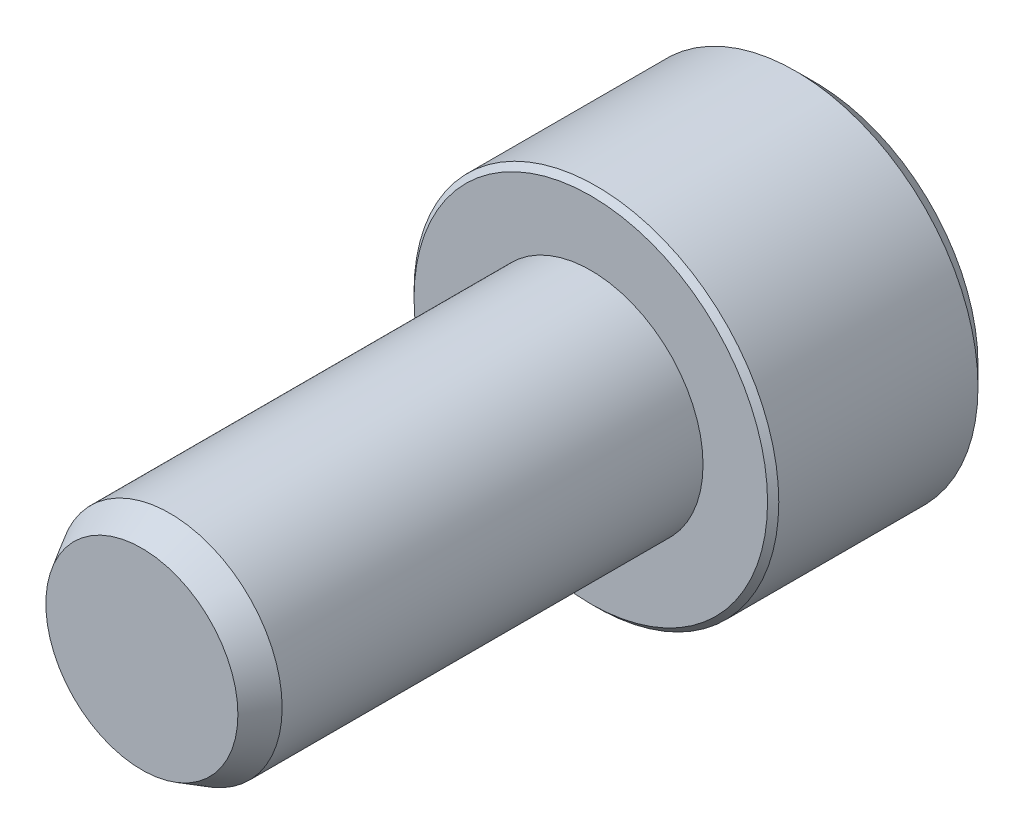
ISO-10303-21;
HEADER;
FILE_DESCRIPTION(('STEP AP214'),'2;1');
FILE_NAME('part.step','',(''),(''),'','','');
FILE_SCHEMA(('AUTOMOTIVE_DESIGN { 1 0 10303 214 1 1 1 1 }'));
ENDSEC;
DATA;
#1=APPLICATION_CONTEXT('core data for automotive mechanical design processes');
#2=APPLICATION_PROTOCOL_DEFINITION('international standard','automotive_design',2000,#1);
#3=PRODUCT_CONTEXT('',#1,'mechanical');
#4=PRODUCT('Part','Part','',(#3));
#5=PRODUCT_RELATED_PRODUCT_CATEGORY('part','',(#4));
#6=PRODUCT_DEFINITION_FORMATION('','',#4);
#7=PRODUCT_DEFINITION_CONTEXT('part definition',#1,'design');
#8=PRODUCT_DEFINITION('design','',#6,#7);
#9=PRODUCT_DEFINITION_SHAPE('','',#8);
#10=(LENGTH_UNIT() NAMED_UNIT(*) SI_UNIT(.MILLI.,.METRE.));
#11=(NAMED_UNIT(*) PLANE_ANGLE_UNIT() SI_UNIT($,.RADIAN.));
#12=(NAMED_UNIT(*) SI_UNIT($,.STERADIAN.) SOLID_ANGLE_UNIT());
#13=UNCERTAINTY_MEASURE_WITH_UNIT(LENGTH_MEASURE(1.E-05),#10,'distance_accuracy_value','');
#14=(GEOMETRIC_REPRESENTATION_CONTEXT(3) GLOBAL_UNCERTAINTY_ASSIGNED_CONTEXT((#13)) GLOBAL_UNIT_ASSIGNED_CONTEXT((#10,
#11,#12)) REPRESENTATION_CONTEXT('',''));
#15=CARTESIAN_POINT('',(0.,0.,0.));
#16=DIRECTION('',(0.,0.,1.));
#17=DIRECTION('',(1.,0.,0.));
#18=AXIS2_PLACEMENT_3D('',#15,#16,#17);
#19=CARTESIAN_POINT('',(0.,0.,16.));
#20=DIRECTION('',(0.,0.,-1.));
#21=DIRECTION('',(-1.,0.,0.));
#22=AXIS2_PLACEMENT_3D('',#19,#20,#21);
#23=CYLINDRICAL_SURFACE('',#22,4.);
#24=CARTESIAN_POINT('',(0.,0.,15.));
#25=DIRECTION('',(0.,0.,1.));
#26=DIRECTION('',(1.,0.,0.));
#27=AXIS2_PLACEMENT_3D('',#24,#25,#26);
#28=CIRCLE('',#27,4.);
#29=CARTESIAN_POINT('',(4.,0.,15.));
#30=VERTEX_POINT('',#29);
#31=EDGE_CURVE('E150',#30,#30,#28,.F.);
#32=ORIENTED_EDGE('',*,*,#31,.T.);
#33=EDGE_LOOP('',(#32));
#34=FACE_BOUND('',#33,.T.);
#35=CARTESIAN_POINT('',(0.,0.,0.));
#36=DIRECTION('',(0.,0.,1.));
#37=DIRECTION('',(1.,0.,0.));
#38=AXIS2_PLACEMENT_3D('',#35,#36,#37);
#39=CIRCLE('',#38,4.);
#40=CARTESIAN_POINT('',(4.,0.,0.));
#41=VERTEX_POINT('',#40);
#42=EDGE_CURVE('E132',#41,#41,#39,.T.);
#43=ORIENTED_EDGE('',*,*,#42,.T.);
#44=EDGE_LOOP('',(#43));
#45=FACE_BOUND('',#44,.T.);
#46=ADVANCED_FACE('F31',(#34,#45),#23,.T.);
#47=CARTESIAN_POINT('',(0.,0.,16.));
#48=DIRECTION('',(0.,0.,1.));
#49=DIRECTION('',(1.,0.,0.));
#50=AXIS2_PLACEMENT_3D('',#47,#48,#49);
#51=PLANE('',#50);
#52=CARTESIAN_POINT('',(0.,0.,16.));
#53=DIRECTION('',(0.,0.,1.));
#54=DIRECTION('',(1.,0.,0.));
#55=AXIS2_PLACEMENT_3D('',#52,#53,#54);
#56=CIRCLE('',#55,3.42264973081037);
#57=CARTESIAN_POINT('',(3.42264973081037,0.,16.));
#58=VERTEX_POINT('',#57);
#59=EDGE_CURVE('E147',#58,#58,#56,.T.);
#60=ORIENTED_EDGE('',*,*,#59,.T.);
#61=EDGE_LOOP('',(#60));
#62=FACE_BOUND('',#61,.T.);
#63=ADVANCED_FACE('F171',(#62),#51,.T.);
#64=CARTESIAN_POINT('',(0.,0.,0.));
#65=DIRECTION('',(0.,0.,1.));
#66=DIRECTION('',(1.,0.,0.));
#67=AXIS2_PLACEMENT_3D('',#64,#65,#66);
#68=PLANE('',#67);
#69=CARTESIAN_POINT('',(0.,0.,0.));
#70=DIRECTION('',(0.,0.,1.));
#71=DIRECTION('',(1.,0.,0.));
#72=AXIS2_PLACEMENT_3D('',#69,#70,#71);
#73=CIRCLE('',#72,6.3);
#74=CARTESIAN_POINT('',(-6.3,0.,0.));
#75=VERTEX_POINT('',#74);
#76=EDGE_CURVE('E38',#75,#75,#73,.T.);
#77=ORIENTED_EDGE('',*,*,#76,.T.);
#78=EDGE_LOOP('',(#77));
#79=FACE_BOUND('',#78,.T.);
#80=ORIENTED_EDGE('',*,*,#42,.F.);
#81=EDGE_LOOP('',(#80));
#82=FACE_BOUND('',#81,.T.);
#83=ADVANCED_FACE('F155',(#79,#82),#68,.T.);
#84=CARTESIAN_POINT('',(0.,0.,-8.));
#85=DIRECTION('',(0.,0.,1.));
#86=DIRECTION('',(1.,0.,0.));
#87=AXIS2_PLACEMENT_3D('',#84,#85,#86);
#88=CYLINDRICAL_SURFACE('',#87,6.5);
#89=CARTESIAN_POINT('',(0.,0.,-0.2));
#90=DIRECTION('',(0.,0.,1.));
#91=DIRECTION('',(1.,0.,0.));
#92=AXIS2_PLACEMENT_3D('',#89,#90,#91);
#93=CIRCLE('',#92,6.5);
#94=CARTESIAN_POINT('',(-6.5,0.,-0.2));
#95=VERTEX_POINT('',#94);
#96=EDGE_CURVE('E11',#95,#95,#93,.F.);
#97=ORIENTED_EDGE('',*,*,#96,.T.);
#98=EDGE_LOOP('',(#97));
#99=FACE_BOUND('',#98,.T.);
#100=CARTESIAN_POINT('',(0.,0.,-7.3));
#101=DIRECTION('',(0.,0.,1.));
#102=DIRECTION('',(1.,0.,0.));
#103=AXIS2_PLACEMENT_3D('',#100,#101,#102);
#104=CIRCLE('',#103,6.5);
#105=CARTESIAN_POINT('',(6.5,0.,-7.3));
#106=VERTEX_POINT('',#105);
#107=EDGE_CURVE('E141',#106,#106,#104,.T.);
#108=ORIENTED_EDGE('',*,*,#107,.T.);
#109=EDGE_LOOP('',(#108));
#110=FACE_BOUND('',#109,.T.);
#111=ADVANCED_FACE('F181',(#99,#110),#88,.T.);
#112=CARTESIAN_POINT('',(0.,0.,-8.));
#113=DIRECTION('',(0.,0.,1.));
#114=DIRECTION('',(1.,0.,0.));
#115=AXIS2_PLACEMENT_3D('',#112,#113,#114);
#116=PLANE('',#115);
#117=CARTESIAN_POINT('',(0.,0.,-8.));
#118=DIRECTION('',(0.,0.,1.));
#119=DIRECTION('',(1.,0.,0.));
#120=AXIS2_PLACEMENT_3D('',#117,#118,#119);
#121=CIRCLE('',#120,5.8);
#122=CARTESIAN_POINT('',(5.8,0.,-8.));
#123=VERTEX_POINT('',#122);
#124=EDGE_CURVE('E144',#123,#123,#121,.F.);
#125=ORIENTED_EDGE('',*,*,#124,.T.);
#126=EDGE_LOOP('',(#125));
#127=FACE_BOUND('',#126,.T.);
#128=DIRECTION('',(0.5,0.866025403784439,0.));
#129=VECTOR('',#128,1.);
#130=CARTESIAN_POINT('',(-3.46410161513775,0.,-8.));
#131=LINE('',#130,#129);
#132=CARTESIAN_POINT('',(-3.46410161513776,0.,-8.));
#133=VERTEX_POINT('',#132);
#134=CARTESIAN_POINT('',(-1.73205080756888,3.,-8.));
#135=VERTEX_POINT('',#134);
#136=EDGE_CURVE('E99',#133,#135,#131,.T.);
#137=ORIENTED_EDGE('',*,*,#136,.F.);
#138=DIRECTION('',(-0.5,0.866025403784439,0.));
#139=VECTOR('',#138,1.);
#140=CARTESIAN_POINT('',(-1.73205080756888,-3.,-8.));
#141=LINE('',#140,#139);
#142=CARTESIAN_POINT('',(-1.73205080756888,-3.,-8.));
#143=VERTEX_POINT('',#142);
#144=EDGE_CURVE('E45',#143,#133,#141,.T.);
#145=ORIENTED_EDGE('',*,*,#144,.F.);
#146=DIRECTION('',(-1.,0.,0.));
#147=VECTOR('',#146,1.);
#148=CARTESIAN_POINT('',(1.73205080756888,-3.,-8.));
#149=LINE('',#148,#147);
#150=CARTESIAN_POINT('',(1.73205080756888,-3.,-8.));
#151=VERTEX_POINT('',#150);
#152=EDGE_CURVE('E114',#151,#143,#149,.T.);
#153=ORIENTED_EDGE('',*,*,#152,.F.);
#154=DIRECTION('',(-0.5,-0.866025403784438,0.));
#155=VECTOR('',#154,1.);
#156=CARTESIAN_POINT('',(3.46410161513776,0.,-8.));
#157=LINE('',#156,#155);
#158=CARTESIAN_POINT('',(3.46410161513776,0.,-8.));
#159=VERTEX_POINT('',#158);
#160=EDGE_CURVE('E108',#159,#151,#157,.T.);
#161=ORIENTED_EDGE('',*,*,#160,.F.);
#162=DIRECTION('',(0.5,-0.866025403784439,0.));
#163=VECTOR('',#162,1.);
#164=CARTESIAN_POINT('',(1.73205080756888,3.,-8.));
#165=LINE('',#164,#163);
#166=CARTESIAN_POINT('',(1.73205080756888,3.,-8.));
#167=VERTEX_POINT('',#166);
#168=EDGE_CURVE('E106',#167,#159,#165,.T.);
#169=ORIENTED_EDGE('',*,*,#168,.F.);
#170=DIRECTION('',(1.,0.,0.));
#171=VECTOR('',#170,1.);
#172=CARTESIAN_POINT('',(-1.73205080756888,3.,-8.));
#173=LINE('',#172,#171);
#174=EDGE_CURVE('E88',#135,#167,#173,.T.);
#175=ORIENTED_EDGE('',*,*,#174,.F.);
#176=EDGE_LOOP('',(#137,#145,#153,#161,#169,#175));
#177=FACE_BOUND('',#176,.T.);
#178=ADVANCED_FACE('F103',(#127,#177),#116,.F.);
#179=CARTESIAN_POINT('',(-1.73205080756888,-3.,-3.5));
#180=DIRECTION('',(-0.866025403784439,-0.5,0.));
#181=DIRECTION('',(0.5,-0.866025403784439,0.));
#182=AXIS2_PLACEMENT_3D('',#179,#180,#181);
#183=PLANE('',#182);
#184=ORIENTED_EDGE('',*,*,#144,.T.);
#185=DIRECTION('',(0.,0.,-1.));
#186=VECTOR('',#185,1.);
#187=CARTESIAN_POINT('',(-3.46410161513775,0.,-3.5));
#188=LINE('',#187,#186);
#189=CARTESIAN_POINT('',(-3.46410161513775,0.,-3.5));
#190=VERTEX_POINT('',#189);
#191=EDGE_CURVE('E96',#190,#133,#188,.T.);
#192=ORIENTED_EDGE('',*,*,#191,.F.);
#193=DIRECTION('',(-0.5,0.866025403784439,0.));
#194=VECTOR('',#193,1.);
#195=CARTESIAN_POINT('',(-1.73205080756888,-3.,-3.5));
#196=LINE('',#195,#194);
#197=CARTESIAN_POINT('',(-1.73205080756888,-3.,-3.5));
#198=VERTEX_POINT('',#197);
#199=EDGE_CURVE('E116',#198,#190,#196,.T.);
#200=ORIENTED_EDGE('',*,*,#199,.F.);
#201=DIRECTION('',(0.,0.,-1.));
#202=VECTOR('',#201,1.);
#203=CARTESIAN_POINT('',(-1.73205080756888,-3.,-3.5));
#204=LINE('',#203,#202);
#205=EDGE_CURVE('E52',#198,#143,#204,.T.);
#206=ORIENTED_EDGE('',*,*,#205,.T.);
#207=EDGE_LOOP('',(#184,#192,#200,#206));
#208=FACE_BOUND('',#207,.T.);
#209=ADVANCED_FACE('F190',(#208),#183,.F.);
#210=CARTESIAN_POINT('',(1.73205080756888,-3.,-3.5));
#211=DIRECTION('',(0.,-1.,0.));
#212=DIRECTION('',(0.,0.,-1.));
#213=AXIS2_PLACEMENT_3D('',#210,#211,#212);
#214=PLANE('',#213);
#215=ORIENTED_EDGE('',*,*,#152,.T.);
#216=ORIENTED_EDGE('',*,*,#205,.F.);
#217=DIRECTION('',(-1.,0.,0.));
#218=VECTOR('',#217,1.);
#219=CARTESIAN_POINT('',(1.73205080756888,-3.,-3.5));
#220=LINE('',#219,#218);
#221=CARTESIAN_POINT('',(1.73205080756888,-3.,-3.5));
#222=VERTEX_POINT('',#221);
#223=EDGE_CURVE('E128',#222,#198,#220,.T.);
#224=ORIENTED_EDGE('',*,*,#223,.F.);
#225=DIRECTION('',(0.,0.,-1.));
#226=VECTOR('',#225,1.);
#227=CARTESIAN_POINT('',(1.73205080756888,-3.,-3.5));
#228=LINE('',#227,#226);
#229=EDGE_CURVE('E133',#222,#151,#228,.T.);
#230=ORIENTED_EDGE('',*,*,#229,.T.);
#231=EDGE_LOOP('',(#215,#216,#224,#230));
#232=FACE_BOUND('',#231,.T.);
#233=ADVANCED_FACE('F197',(#232),#214,.F.);
#234=CARTESIAN_POINT('',(3.46410161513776,0.,-3.5));
#235=DIRECTION('',(0.866025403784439,-0.5,0.));
#236=DIRECTION('',(0.5,0.866025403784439,0.));
#237=AXIS2_PLACEMENT_3D('',#234,#235,#236);
#238=PLANE('',#237);
#239=ORIENTED_EDGE('',*,*,#160,.T.);
#240=ORIENTED_EDGE('',*,*,#229,.F.);
#241=DIRECTION('',(-0.5,-0.866025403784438,0.));
#242=VECTOR('',#241,1.);
#243=CARTESIAN_POINT('',(3.46410161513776,0.,-3.5));
#244=LINE('',#243,#242);
#245=CARTESIAN_POINT('',(3.46410161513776,0.,-3.5));
#246=VERTEX_POINT('',#245);
#247=EDGE_CURVE('E125',#246,#222,#244,.T.);
#248=ORIENTED_EDGE('',*,*,#247,.F.);
#249=DIRECTION('',(0.,0.,-1.));
#250=VECTOR('',#249,1.);
#251=CARTESIAN_POINT('',(3.46410161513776,0.,-3.5));
#252=LINE('',#251,#250);
#253=EDGE_CURVE('E135',#246,#159,#252,.T.);
#254=ORIENTED_EDGE('',*,*,#253,.T.);
#255=EDGE_LOOP('',(#239,#240,#248,#254));
#256=FACE_BOUND('',#255,.T.);
#257=ADVANCED_FACE('F214',(#256),#238,.F.);
#258=CARTESIAN_POINT('',(1.73205080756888,3.,-3.5));
#259=DIRECTION('',(0.866025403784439,0.5,0.));
#260=DIRECTION('',(-0.5,0.866025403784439,0.));
#261=AXIS2_PLACEMENT_3D('',#258,#259,#260);
#262=PLANE('',#261);
#263=ORIENTED_EDGE('',*,*,#168,.T.);
#264=ORIENTED_EDGE('',*,*,#253,.F.);
#265=DIRECTION('',(0.5,-0.866025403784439,0.));
#266=VECTOR('',#265,1.);
#267=CARTESIAN_POINT('',(1.73205080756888,3.,-3.5));
#268=LINE('',#267,#266);
#269=CARTESIAN_POINT('',(1.73205080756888,3.,-3.5));
#270=VERTEX_POINT('',#269);
#271=EDGE_CURVE('E122',#270,#246,#268,.T.);
#272=ORIENTED_EDGE('',*,*,#271,.F.);
#273=DIRECTION('',(0.,0.,-1.));
#274=VECTOR('',#273,1.);
#275=CARTESIAN_POINT('',(1.73205080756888,3.,-3.5));
#276=LINE('',#275,#274);
#277=EDGE_CURVE('E95',#270,#167,#276,.T.);
#278=ORIENTED_EDGE('',*,*,#277,.T.);
#279=EDGE_LOOP('',(#263,#264,#272,#278));
#280=FACE_BOUND('',#279,.T.);
#281=ADVANCED_FACE('F217',(#280),#262,.F.);
#282=CARTESIAN_POINT('',(-1.73205080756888,3.,-3.5));
#283=DIRECTION('',(0.,1.,0.));
#284=DIRECTION('',(0.,0.,1.));
#285=AXIS2_PLACEMENT_3D('',#282,#283,#284);
#286=PLANE('',#285);
#287=ORIENTED_EDGE('',*,*,#174,.T.);
#288=ORIENTED_EDGE('',*,*,#277,.F.);
#289=DIRECTION('',(1.,0.,0.));
#290=VECTOR('',#289,1.);
#291=CARTESIAN_POINT('',(-1.73205080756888,3.,-3.5));
#292=LINE('',#291,#290);
#293=CARTESIAN_POINT('',(-1.73205080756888,3.,-3.5));
#294=VERTEX_POINT('',#293);
#295=EDGE_CURVE('E91',#294,#270,#292,.T.);
#296=ORIENTED_EDGE('',*,*,#295,.F.);
#297=DIRECTION('',(0.,0.,-1.));
#298=VECTOR('',#297,1.);
#299=CARTESIAN_POINT('',(-1.73205080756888,3.,-3.5));
#300=LINE('',#299,#298);
#301=EDGE_CURVE('E84',#294,#135,#300,.T.);
#302=ORIENTED_EDGE('',*,*,#301,.T.);
#303=EDGE_LOOP('',(#287,#288,#296,#302));
#304=FACE_BOUND('',#303,.T.);
#305=ADVANCED_FACE('F86',(#304),#286,.F.);
#306=CARTESIAN_POINT('',(-3.46410161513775,0.,-3.5));
#307=DIRECTION('',(-0.866025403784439,0.5,0.));
#308=DIRECTION('',(-0.5,-0.866025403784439,0.));
#309=AXIS2_PLACEMENT_3D('',#306,#307,#308);
#310=PLANE('',#309);
#311=ORIENTED_EDGE('',*,*,#136,.T.);
#312=ORIENTED_EDGE('',*,*,#301,.F.);
#313=DIRECTION('',(0.5,0.866025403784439,0.));
#314=VECTOR('',#313,1.);
#315=CARTESIAN_POINT('',(-3.46410161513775,0.,-3.5));
#316=LINE('',#315,#314);
#317=EDGE_CURVE('E119',#190,#294,#316,.T.);
#318=ORIENTED_EDGE('',*,*,#317,.F.);
#319=ORIENTED_EDGE('',*,*,#191,.T.);
#320=EDGE_LOOP('',(#311,#312,#318,#319));
#321=FACE_BOUND('',#320,.T.);
#322=ADVANCED_FACE('F100',(#321),#310,.F.);
#323=CARTESIAN_POINT('',(-5.19615242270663,3.,-3.5));
#324=DIRECTION('',(0.,0.,-1.));
#325=DIRECTION('',(-1.,0.,0.));
#326=AXIS2_PLACEMENT_3D('',#323,#324,#325);
#327=PLANE('',#326);
#328=ORIENTED_EDGE('',*,*,#199,.T.);
#329=ORIENTED_EDGE('',*,*,#317,.T.);
#330=ORIENTED_EDGE('',*,*,#295,.T.);
#331=ORIENTED_EDGE('',*,*,#271,.T.);
#332=ORIENTED_EDGE('',*,*,#247,.T.);
#333=ORIENTED_EDGE('',*,*,#223,.T.);
#334=EDGE_LOOP('',(#328,#329,#330,#331,#332,#333));
#335=FACE_BOUND('',#334,.T.);
#336=ADVANCED_FACE('F202',(#335),#327,.T.);
#337=CARTESIAN_POINT('',(0.,0.,-7.3));
#338=DIRECTION('',(0.,0.,1.));
#339=DIRECTION('',(1.,0.,0.));
#340=AXIS2_PLACEMENT_3D('',#337,#338,#339);
#341=CONICAL_SURFACE('',#340,6.5,0.785398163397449);
#342=ORIENTED_EDGE('',*,*,#124,.F.);
#343=EDGE_LOOP('',(#342));
#344=FACE_BOUND('',#343,.T.);
#345=ORIENTED_EDGE('',*,*,#107,.F.);
#346=EDGE_LOOP('',(#345));
#347=FACE_BOUND('',#346,.T.);
#348=ADVANCED_FACE('F166',(#344,#347),#341,.T.);
#349=CARTESIAN_POINT('',(0.,0.,16.));
#350=DIRECTION('',(0.,0.,-1.));
#351=DIRECTION('',(-1.,0.,0.));
#352=AXIS2_PLACEMENT_3D('',#349,#350,#351);
#353=CONICAL_SURFACE('',#352,3.42264973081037,0.523598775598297);
#354=ORIENTED_EDGE('',*,*,#31,.F.);
#355=EDGE_LOOP('',(#354));
#356=FACE_BOUND('',#355,.T.);
#357=ORIENTED_EDGE('',*,*,#59,.F.);
#358=EDGE_LOOP('',(#357));
#359=FACE_BOUND('',#358,.T.);
#360=ADVANCED_FACE('F160',(#356,#359),#353,.T.);
#361=CARTESIAN_POINT('',(0.,0.,0.));
#362=DIRECTION('',(0.,0.,-1.));
#363=DIRECTION('',(-1.,0.,0.));
#364=AXIS2_PLACEMENT_3D('',#361,#362,#363);
#365=CONICAL_SURFACE('',#364,6.3,0.785398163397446);
#366=CARTESIAN_POINT('',(-6.5,0.,-0.2));
#367=CARTESIAN_POINT('',(-6.49791666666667,0.,-0.197916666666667));
#368=CARTESIAN_POINT('',(-6.49583333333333,0.,-0.195833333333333));
#369=CARTESIAN_POINT('',(-6.49166666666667,0.,-0.191666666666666));
#370=CARTESIAN_POINT('',(-6.48958333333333,0.,-0.189583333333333));
#371=CARTESIAN_POINT('',(-6.48541666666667,0.,-0.185416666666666));
#372=CARTESIAN_POINT('',(-6.48333333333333,0.,-0.183333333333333));
#373=CARTESIAN_POINT('',(-6.47916666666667,0.,-0.179166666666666));
#374=CARTESIAN_POINT('',(-6.47708333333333,0.,-0.177083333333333));
#375=CARTESIAN_POINT('',(-6.47291666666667,0.,-0.172916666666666));
#376=CARTESIAN_POINT('',(-6.47083333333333,0.,-0.170833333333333));
#377=CARTESIAN_POINT('',(-6.46666666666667,0.,-0.166666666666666));
#378=CARTESIAN_POINT('',(-6.46458333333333,0.,-0.164583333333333));
#379=CARTESIAN_POINT('',(-6.46041666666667,0.,-0.160416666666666));
#380=CARTESIAN_POINT('',(-6.45833333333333,0.,-0.158333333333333));
#381=CARTESIAN_POINT('',(-6.45416666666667,0.,-0.154166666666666));
#382=CARTESIAN_POINT('',(-6.45208333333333,0.,-0.152083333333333));
#383=CARTESIAN_POINT('',(-6.44791666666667,0.,-0.147916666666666));
#384=CARTESIAN_POINT('',(-6.44583333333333,0.,-0.145833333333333));
#385=CARTESIAN_POINT('',(-6.44166666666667,0.,-0.141666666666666));
#386=CARTESIAN_POINT('',(-6.43958333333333,0.,-0.139583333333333));
#387=CARTESIAN_POINT('',(-6.43541666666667,0.,-0.135416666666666));
#388=CARTESIAN_POINT('',(-6.43333333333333,0.,-0.133333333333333));
#389=CARTESIAN_POINT('',(-6.42916666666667,0.,-0.129166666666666));
#390=CARTESIAN_POINT('',(-6.42708333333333,0.,-0.127083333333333));
#391=CARTESIAN_POINT('',(-6.42291666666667,0.,-0.122916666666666));
#392=CARTESIAN_POINT('',(-6.42083333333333,0.,-0.120833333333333));
#393=CARTESIAN_POINT('',(-6.41666666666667,0.,-0.116666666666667));
#394=CARTESIAN_POINT('',(-6.41458333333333,0.,-0.114583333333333));
#395=CARTESIAN_POINT('',(-6.41041666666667,0.,-0.110416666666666));
#396=CARTESIAN_POINT('',(-6.40833333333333,0.,-0.108333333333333));
#397=CARTESIAN_POINT('',(-6.40416666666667,0.,-0.104166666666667));
#398=CARTESIAN_POINT('',(-6.40208333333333,0.,-0.102083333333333));
#399=CARTESIAN_POINT('',(-6.39791666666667,0.,-0.0979166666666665));
#400=CARTESIAN_POINT('',(-6.39583333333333,0.,-0.0958333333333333));
#401=CARTESIAN_POINT('',(-6.39166666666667,0.,-0.0916666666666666));
#402=CARTESIAN_POINT('',(-6.38958333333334,0.,-0.0895833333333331));
#403=CARTESIAN_POINT('',(-6.38541666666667,0.,-0.0854166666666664));
#404=CARTESIAN_POINT('',(-6.38333333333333,0.,-0.0833333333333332));
#405=CARTESIAN_POINT('',(-6.37916666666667,0.,-0.0791666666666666));
#406=CARTESIAN_POINT('',(-6.37708333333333,0.,-0.0770833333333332));
#407=CARTESIAN_POINT('',(-6.37291666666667,0.,-0.0729166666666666));
#408=CARTESIAN_POINT('',(-6.37083333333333,0.,-0.0708333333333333));
#409=CARTESIAN_POINT('',(-6.36666666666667,0.,-0.0666666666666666));
#410=CARTESIAN_POINT('',(-6.36458333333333,0.,-0.0645833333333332));
#411=CARTESIAN_POINT('',(-6.36041666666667,0.,-0.0604166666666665));
#412=CARTESIAN_POINT('',(-6.35833333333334,0.,-0.0583333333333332));
#413=CARTESIAN_POINT('',(-6.35416666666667,0.,-0.0541666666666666));
#414=CARTESIAN_POINT('',(-6.35208333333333,0.,-0.0520833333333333));
#415=CARTESIAN_POINT('',(-6.34791666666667,0.,-0.0479166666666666));
#416=CARTESIAN_POINT('',(-6.34583333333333,0.,-0.0458333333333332));
#417=CARTESIAN_POINT('',(-6.34166666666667,0.,-0.0416666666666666));
#418=CARTESIAN_POINT('',(-6.33958333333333,0.,-0.0395833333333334));
#419=CARTESIAN_POINT('',(-6.33541666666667,0.,-0.0354166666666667));
#420=CARTESIAN_POINT('',(-6.33333333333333,0.,-0.0333333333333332));
#421=CARTESIAN_POINT('',(-6.32916666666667,0.,-0.0291666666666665));
#422=CARTESIAN_POINT('',(-6.32708333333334,0.,-0.0270833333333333));
#423=CARTESIAN_POINT('',(-6.32291666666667,0.,-0.0229166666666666));
#424=CARTESIAN_POINT('',(-6.32083333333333,0.,-0.0208333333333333));
#425=CARTESIAN_POINT('',(-6.31666666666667,0.,-0.0166666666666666));
#426=CARTESIAN_POINT('',(-6.31458333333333,0.,-0.0145833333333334));
#427=CARTESIAN_POINT('',(-6.31041666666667,0.,-0.0104166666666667));
#428=CARTESIAN_POINT('',(-6.30833333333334,0.,-0.00833333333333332));
#429=CARTESIAN_POINT('',(-6.30416666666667,0.,-0.00416666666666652));
#430=CARTESIAN_POINT('',(-6.30208333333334,0.,-0.00208333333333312));
#431=CARTESIAN_POINT('',(-6.3,0.,0.));
#432=B_SPLINE_CURVE_WITH_KNOTS('',3,(#366,#367,#368,#369,#370,#371,#372,#373,#374,#375,#376,
#377,#378,#379,#380,#381,#382,#383,#384,#385,#386,#387,#388,#389,#390,#391,#392,#393,#394,#395,
#396,#397,#398,#399,#400,#401,#402,#403,#404,#405,#406,#407,#408,#409,#410,#411,#412,#413,#414,
#415,#416,#417,#418,#419,#420,#421,#422,#423,#424,#425,#426,#427,#428,#429,#430,#431),
.UNSPECIFIED.,.F.,.F.,(4,2,2,2,2,2,2,2,2,2,2,2,2,2,2,2,2,2,2,2,2,2,2,2,2,2,2,2,2,2,2,2,4),(0.,
0.00883883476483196,0.0176776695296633,0.0265165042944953,0.0353553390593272,0.0441941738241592,
0.0530330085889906,0.0618718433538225,0.0707106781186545,0.0795495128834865,0.0883883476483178,
0.0972271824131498,0.106066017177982,0.114904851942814,0.123743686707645,0.132582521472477,
0.141421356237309,0.150260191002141,0.159099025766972,0.167937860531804,0.176776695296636,
0.185615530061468,0.194454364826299,0.203293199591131,0.212132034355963,0.220970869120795,
0.229809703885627,0.238648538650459,0.247487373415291,0.256326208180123,0.265165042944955,
0.274003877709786,0.282842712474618),.UNSPECIFIED.);
#433=EDGE_CURVE('BSEAM158',#95,#75,#432,.T.);
#434=ORIENTED_EDGE('',*,*,#96,.F.);
#435=ORIENTED_EDGE('',*,*,#76,.F.);
#436=ORIENTED_EDGE('',*,*,#433,.T.);
#437=ORIENTED_EDGE('',*,*,#433,.F.);
#438=EDGE_LOOP('',(#434,#436,#435,#437));
#439=FACE_BOUND('',#438,.T.);
#440=ADVANCED_FACE('F158',(#439),#365,.T.);
#441=CLOSED_SHELL('',(#46,#63,#83,#111,#178,#209,#233,#257,#281,#305,#322,#336,#348,#360,#440));
#442=MANIFOLD_SOLID_BREP('B2',#441);
#443=ADVANCED_BREP_SHAPE_REPRESENTATION('',(#18,#442),#14);
#444=SHAPE_DEFINITION_REPRESENTATION(#9,#443);
ENDSEC;
END-ISO-10303-21;
